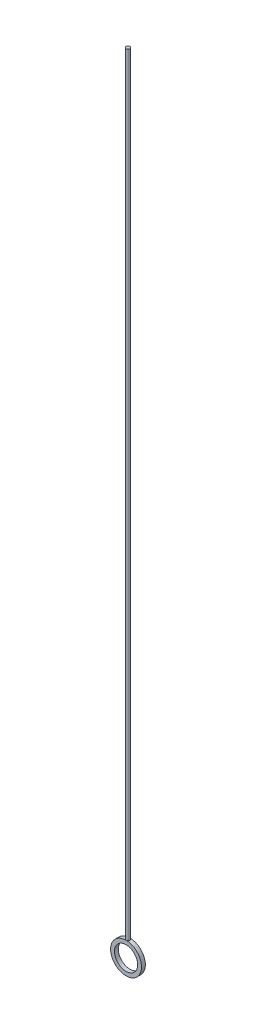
ISO-10303-21;
HEADER;
FILE_DESCRIPTION(('STEP AP214'),'2;1');
FILE_NAME('part.step','',(''),(''),'','','');
FILE_SCHEMA(('AUTOMOTIVE_DESIGN { 1 0 10303 214 1 1 1 1 }'));
ENDSEC;
DATA;
#1=APPLICATION_CONTEXT('core data for automotive mechanical design processes');
#2=APPLICATION_PROTOCOL_DEFINITION('international standard','automotive_design',2000,#1);
#3=PRODUCT_CONTEXT('',#1,'mechanical');
#4=PRODUCT('Part','Part','',(#3));
#5=PRODUCT_RELATED_PRODUCT_CATEGORY('part','',(#4));
#6=PRODUCT_DEFINITION_FORMATION('','',#4);
#7=PRODUCT_DEFINITION_CONTEXT('part definition',#1,'design');
#8=PRODUCT_DEFINITION('design','',#6,#7);
#9=PRODUCT_DEFINITION_SHAPE('','',#8);
#10=(LENGTH_UNIT() NAMED_UNIT(*) SI_UNIT(.MILLI.,.METRE.));
#11=(NAMED_UNIT(*) PLANE_ANGLE_UNIT() SI_UNIT($,.RADIAN.));
#12=(NAMED_UNIT(*) SI_UNIT($,.STERADIAN.) SOLID_ANGLE_UNIT());
#13=UNCERTAINTY_MEASURE_WITH_UNIT(LENGTH_MEASURE(1.E-05),#10,'distance_accuracy_value','');
#14=(GEOMETRIC_REPRESENTATION_CONTEXT(3) GLOBAL_UNCERTAINTY_ASSIGNED_CONTEXT((#13)) GLOBAL_UNIT_ASSIGNED_CONTEXT((#10,
#11,#12)) REPRESENTATION_CONTEXT('',''));
#15=CARTESIAN_POINT('',(0.,0.,0.));
#16=DIRECTION('',(0.,0.,1.));
#17=DIRECTION('',(1.,0.,0.));
#18=AXIS2_PLACEMENT_3D('',#15,#16,#17);
#19=CARTESIAN_POINT('',(0.,204.,0.5));
#20=DIRECTION('',(0.,-1.,0.));
#21=DIRECTION('',(0.,0.,-1.));
#22=AXIS2_PLACEMENT_3D('',#19,#20,#21);
#23=CYLINDRICAL_SURFACE('',#22,0.5);
#24=CARTESIAN_POINT('',(0.,204.,0.5));
#25=DIRECTION('',(0.,1.,0.));
#26=DIRECTION('',(0.,0.,1.));
#27=AXIS2_PLACEMENT_3D('',#24,#25,#26);
#28=CIRCLE('',#27,0.5);
#29=CARTESIAN_POINT('',(0.,204.,1.));
#30=VERTEX_POINT('',#29);
#31=EDGE_CURVE('E11',#30,#30,#28,.T.);
#32=ORIENTED_EDGE('',*,*,#31,.F.);
#33=EDGE_LOOP('',(#32));
#34=FACE_BOUND('',#33,.T.);
#35=CARTESIAN_POINT('',(0.,4.,0.5));
#36=DIRECTION('',(0.,1.,0.));
#37=DIRECTION('',(0.,0.,1.));
#38=AXIS2_PLACEMENT_3D('',#35,#36,#37);
#39=CIRCLE('',#38,0.5);
#40=CARTESIAN_POINT('',(0.,4.,1.));
#41=VERTEX_POINT('',#40);
#42=EDGE_CURVE('E48',#41,#41,#39,.T.);
#43=ORIENTED_EDGE('',*,*,#42,.T.);
#44=EDGE_LOOP('',(#43));
#45=FACE_BOUND('',#44,.T.);
#46=ADVANCED_FACE('F45',(#34,#45),#23,.T.);
#47=CARTESIAN_POINT('',(0.,204.,0.5));
#48=DIRECTION('',(0.,1.,0.));
#49=DIRECTION('',(0.,0.,1.));
#50=AXIS2_PLACEMENT_3D('',#47,#48,#49);
#51=PLANE('',#50);
#52=ORIENTED_EDGE('',*,*,#31,.T.);
#53=EDGE_LOOP('',(#52));
#54=FACE_BOUND('',#53,.T.);
#55=ADVANCED_FACE('F62',(#54),#51,.T.);
#56=CARTESIAN_POINT('',(0.,4.,0.5));
#57=DIRECTION('',(0.,1.,0.));
#58=DIRECTION('',(0.,0.,1.));
#59=AXIS2_PLACEMENT_3D('',#56,#57,#58);
#60=PLANE('',#59);
#61=ORIENTED_EDGE('',*,*,#42,.F.);
#62=EDGE_LOOP('',(#61));
#63=FACE_BOUND('',#62,.T.);
#64=ADVANCED_FACE('F60',(#63),#60,.F.);
#65=CLOSED_SHELL('',(#46,#55,#64));
#66=MANIFOLD_SOLID_BREP('B2',#65);
#67=CARTESIAN_POINT('',(0.,0.,1.));
#68=DIRECTION('',(0.,0.,-1.));
#69=DIRECTION('',(-1.,0.,0.));
#70=AXIS2_PLACEMENT_3D('',#67,#68,#69);
#71=CYLINDRICAL_SURFACE('',#70,4.);
#72=CARTESIAN_POINT('',(0.,0.,0.));
#73=DIRECTION('',(0.,0.,1.));
#74=DIRECTION('',(1.,0.,0.));
#75=AXIS2_PLACEMENT_3D('',#72,#73,#74);
#76=CIRCLE('',#75,4.);
#77=CARTESIAN_POINT('',(4.,0.,0.));
#78=VERTEX_POINT('',#77);
#79=EDGE_CURVE('E95',#78,#78,#76,.T.);
#80=ORIENTED_EDGE('',*,*,#79,.T.);
#81=EDGE_LOOP('',(#80));
#82=FACE_BOUND('',#81,.T.);
#83=CARTESIAN_POINT('',(0.,0.,1.));
#84=DIRECTION('',(0.,0.,1.));
#85=DIRECTION('',(1.,0.,0.));
#86=AXIS2_PLACEMENT_3D('',#83,#84,#85);
#87=CIRCLE('',#86,4.);
#88=CARTESIAN_POINT('',(4.,0.,1.));
#89=VERTEX_POINT('',#88);
#90=EDGE_CURVE('E44',#89,#89,#87,.T.);
#91=ORIENTED_EDGE('',*,*,#90,.F.);
#92=EDGE_LOOP('',(#91));
#93=FACE_BOUND('',#92,.T.);
#94=ADVANCED_FACE('F88',(#82,#93),#71,.T.);
#95=CARTESIAN_POINT('',(0.,0.,1.));
#96=DIRECTION('',(0.,0.,1.));
#97=DIRECTION('',(1.,0.,0.));
#98=AXIS2_PLACEMENT_3D('',#95,#96,#97);
#99=PLANE('',#98);
#100=CARTESIAN_POINT('',(0.,0.,1.));
#101=DIRECTION('',(0.,0.,1.));
#102=DIRECTION('',(1.,0.,0.));
#103=AXIS2_PLACEMENT_3D('',#100,#101,#102);
#104=CIRCLE('',#103,3.);
#105=CARTESIAN_POINT('',(3.,0.,1.));
#106=VERTEX_POINT('',#105);
#107=EDGE_CURVE('E101',#106,#106,#104,.T.);
#108=ORIENTED_EDGE('',*,*,#107,.F.);
#109=EDGE_LOOP('',(#108));
#110=FACE_BOUND('',#109,.T.);
#111=ORIENTED_EDGE('',*,*,#90,.T.);
#112=EDGE_LOOP('',(#111));
#113=FACE_BOUND('',#112,.T.);
#114=ADVANCED_FACE('F117',(#110,#113),#99,.T.);
#115=CARTESIAN_POINT('',(0.,0.,0.));
#116=DIRECTION('',(0.,0.,1.));
#117=DIRECTION('',(1.,0.,0.));
#118=AXIS2_PLACEMENT_3D('',#115,#116,#117);
#119=PLANE('',#118);
#120=CARTESIAN_POINT('',(0.,0.,0.));
#121=DIRECTION('',(0.,0.,1.));
#122=DIRECTION('',(1.,0.,0.));
#123=AXIS2_PLACEMENT_3D('',#120,#121,#122);
#124=CIRCLE('',#123,3.);
#125=CARTESIAN_POINT('',(3.,0.,0.));
#126=VERTEX_POINT('',#125);
#127=EDGE_CURVE('E91',#126,#126,#124,.T.);
#128=ORIENTED_EDGE('',*,*,#127,.T.);
#129=EDGE_LOOP('',(#128));
#130=FACE_BOUND('',#129,.T.);
#131=ORIENTED_EDGE('',*,*,#79,.F.);
#132=EDGE_LOOP('',(#131));
#133=FACE_BOUND('',#132,.T.);
#134=ADVANCED_FACE('F108',(#130,#133),#119,.F.);
#135=CARTESIAN_POINT('',(0.,0.,-1.));
#136=DIRECTION('',(0.,0.,1.));
#137=DIRECTION('',(1.,0.,0.));
#138=AXIS2_PLACEMENT_3D('',#135,#136,#137);
#139=CYLINDRICAL_SURFACE('',#138,3.);
#140=ORIENTED_EDGE('',*,*,#107,.T.);
#141=EDGE_LOOP('',(#140));
#142=FACE_BOUND('',#141,.T.);
#143=ORIENTED_EDGE('',*,*,#127,.F.);
#144=EDGE_LOOP('',(#143));
#145=FACE_BOUND('',#144,.T.);
#146=ADVANCED_FACE('F111',(#142,#145),#139,.F.);
#147=CLOSED_SHELL('',(#94,#114,#134,#146));
#148=MANIFOLD_SOLID_BREP('B6',#147);
#149=ADVANCED_BREP_SHAPE_REPRESENTATION('',(#18,#66,#148),#14);
#150=SHAPE_DEFINITION_REPRESENTATION(#9,#149);
ENDSEC;
END-ISO-10303-21;
